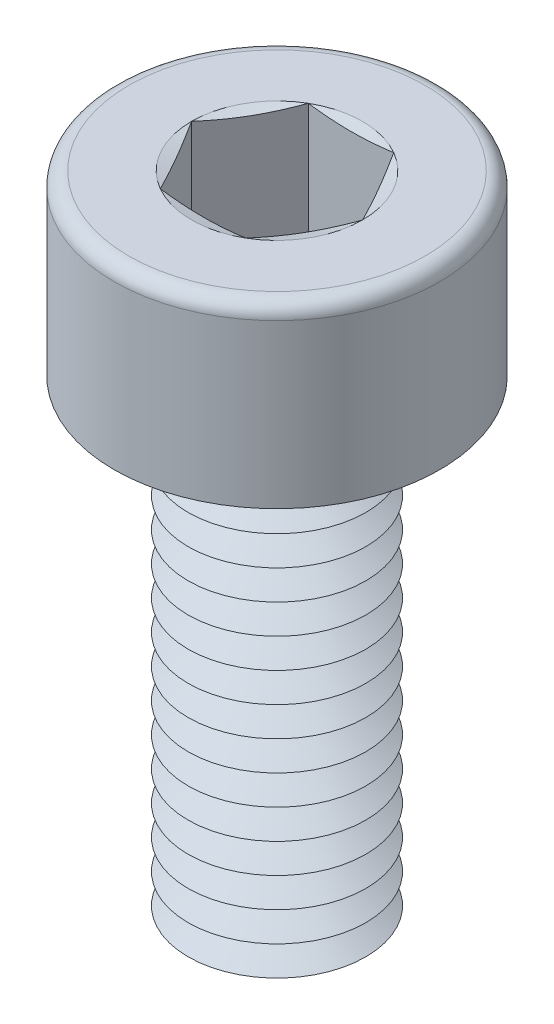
ISO-10303-21;
HEADER;
FILE_DESCRIPTION(('STEP AP214'),'2;1');
FILE_NAME('part.step','',(''),(''),'','','');
FILE_SCHEMA(('AUTOMOTIVE_DESIGN { 1 0 10303 214 1 1 1 1 }'));
ENDSEC;
DATA;
#1=APPLICATION_CONTEXT('core data for automotive mechanical design processes');
#2=APPLICATION_PROTOCOL_DEFINITION('international standard','automotive_design',2000,#1);
#3=PRODUCT_CONTEXT('',#1,'mechanical');
#4=PRODUCT('Part','Part','',(#3));
#5=PRODUCT_RELATED_PRODUCT_CATEGORY('part','',(#4));
#6=PRODUCT_DEFINITION_FORMATION('','',#4);
#7=PRODUCT_DEFINITION_CONTEXT('part definition',#1,'design');
#8=PRODUCT_DEFINITION('design','',#6,#7);
#9=PRODUCT_DEFINITION_SHAPE('','',#8);
#10=(LENGTH_UNIT() NAMED_UNIT(*) SI_UNIT(.MILLI.,.METRE.));
#11=(NAMED_UNIT(*) PLANE_ANGLE_UNIT() SI_UNIT($,.RADIAN.));
#12=(NAMED_UNIT(*) SI_UNIT($,.STERADIAN.) SOLID_ANGLE_UNIT());
#13=UNCERTAINTY_MEASURE_WITH_UNIT(LENGTH_MEASURE(1.E-05),#10,'distance_accuracy_value','');
#14=(GEOMETRIC_REPRESENTATION_CONTEXT(3) GLOBAL_UNCERTAINTY_ASSIGNED_CONTEXT((#13)) GLOBAL_UNIT_ASSIGNED_CONTEXT((#10,
#11,#12)) REPRESENTATION_CONTEXT('',''));
#15=CARTESIAN_POINT('',(0.,0.,0.));
#16=DIRECTION('',(0.,0.,1.));
#17=DIRECTION('',(1.,0.,0.));
#18=AXIS2_PLACEMENT_3D('',#15,#16,#17);
#19=CARTESIAN_POINT('',(0.,2.,0.));
#20=DIRECTION('',(0.,1.,0.));
#21=DIRECTION('',(0.,0.,1.));
#22=AXIS2_PLACEMENT_3D('',#19,#20,#21);
#23=CONICAL_SURFACE('',#22,1.06698729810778,1.0471975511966);
#24=CARTESIAN_POINT('',(0.,2.25,0.));
#25=DIRECTION('',(0.,1.,0.));
#26=DIRECTION('',(0.,0.,1.));
#27=AXIS2_PLACEMENT_3D('',#24,#25,#26);
#28=CIRCLE('',#27,1.5);
#29=CARTESIAN_POINT('',(0.,2.25,1.5));
#30=VERTEX_POINT('',#29);
#31=EDGE_CURVE('E439',#30,#30,#28,.T.);
#32=ORIENTED_EDGE('',*,*,#31,.F.);
#33=EDGE_LOOP('',(#32));
#34=FACE_BOUND('',#33,.T.);
#35=CARTESIAN_POINT('',(0.,2.,0.));
#36=DIRECTION('',(0.,1.,0.));
#37=DIRECTION('',(0.,0.,1.));
#38=AXIS2_PLACEMENT_3D('',#35,#36,#37);
#39=CIRCLE('',#38,1.06698729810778);
#40=CARTESIAN_POINT('',(0.,2.,1.06698729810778));
#41=VERTEX_POINT('',#40);
#42=EDGE_CURVE('E443',#41,#41,#39,.T.);
#43=ORIENTED_EDGE('',*,*,#42,.T.);
#44=EDGE_LOOP('',(#43));
#45=FACE_BOUND('',#44,.T.);
#46=ADVANCED_FACE('F41',(#34,#45),#23,.T.);
#47=CARTESIAN_POINT('',(0.,1.75,0.));
#48=DIRECTION('',(0.,-1.,0.));
#49=DIRECTION('',(0.,0.,-1.));
#50=AXIS2_PLACEMENT_3D('',#47,#48,#49);
#51=CONICAL_SURFACE('',#50,1.5,1.0471975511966);
#52=ORIENTED_EDGE('',*,*,#42,.F.);
#53=EDGE_LOOP('',(#52));
#54=FACE_BOUND('',#53,.T.);
#55=CARTESIAN_POINT('',(0.,1.75,0.));
#56=DIRECTION('',(0.,1.,0.));
#57=DIRECTION('',(0.,0.,1.));
#58=AXIS2_PLACEMENT_3D('',#55,#56,#57);
#59=CIRCLE('',#58,1.5);
#60=CARTESIAN_POINT('',(0.,1.75,1.5));
#61=VERTEX_POINT('',#60);
#62=EDGE_CURVE('E447',#61,#61,#59,.T.);
#63=ORIENTED_EDGE('',*,*,#62,.T.);
#64=EDGE_LOOP('',(#63));
#65=FACE_BOUND('',#64,.T.);
#66=ADVANCED_FACE('F250',(#54,#65),#51,.T.);
#67=CARTESIAN_POINT('',(0.,0.,0.));
#68=DIRECTION('',(0.,1.,0.));
#69=DIRECTION('',(0.,0.,1.));
#70=AXIS2_PLACEMENT_3D('',#67,#68,#69);
#71=PLANE('',#70);
#72=CARTESIAN_POINT('',(0.,0.,0.));
#73=DIRECTION('',(0.,1.,0.));
#74=DIRECTION('',(0.,0.,1.));
#75=AXIS2_PLACEMENT_3D('',#72,#73,#74);
#76=CIRCLE('',#75,1.06698729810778);
#77=CARTESIAN_POINT('',(0.,0.,1.06698729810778));
#78=VERTEX_POINT('',#77);
#79=EDGE_CURVE('E475',#78,#78,#76,.T.);
#80=ORIENTED_EDGE('',*,*,#79,.F.);
#81=EDGE_LOOP('',(#80));
#82=FACE_BOUND('',#81,.T.);
#83=ADVANCED_FACE('F247',(#82),#71,.F.);
#84=CARTESIAN_POINT('',(0.,0.,0.));
#85=DIRECTION('',(0.,1.,0.));
#86=DIRECTION('',(0.,0.,1.));
#87=AXIS2_PLACEMENT_3D('',#84,#85,#86);
#88=CONICAL_SURFACE('',#87,1.06698729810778,1.0471975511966);
#89=CARTESIAN_POINT('',(0.,0.25,0.));
#90=DIRECTION('',(0.,1.,0.));
#91=DIRECTION('',(0.,0.,1.));
#92=AXIS2_PLACEMENT_3D('',#89,#90,#91);
#93=CIRCLE('',#92,1.5);
#94=CARTESIAN_POINT('',(0.,0.25,1.5));
#95=VERTEX_POINT('',#94);
#96=EDGE_CURVE('E471',#95,#95,#93,.T.);
#97=ORIENTED_EDGE('',*,*,#96,.F.);
#98=EDGE_LOOP('',(#97));
#99=FACE_BOUND('',#98,.T.);
#100=ORIENTED_EDGE('',*,*,#79,.T.);
#101=EDGE_LOOP('',(#100));
#102=FACE_BOUND('',#101,.T.);
#103=ADVANCED_FACE('F249',(#99,#102),#88,.T.);
#104=CARTESIAN_POINT('',(0.,0.25,0.));
#105=DIRECTION('',(0.,-1.,0.));
#106=DIRECTION('',(0.,0.,-1.));
#107=AXIS2_PLACEMENT_3D('',#104,#105,#106);
#108=CONICAL_SURFACE('',#107,1.5,1.0471975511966);
#109=CARTESIAN_POINT('',(0.,0.5,0.));
#110=DIRECTION('',(0.,1.,0.));
#111=DIRECTION('',(0.,0.,1.));
#112=AXIS2_PLACEMENT_3D('',#109,#110,#111);
#113=CIRCLE('',#112,1.06698729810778);
#114=CARTESIAN_POINT('',(0.,0.5,1.06698729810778));
#115=VERTEX_POINT('',#114);
#116=EDGE_CURVE('E467',#115,#115,#113,.T.);
#117=ORIENTED_EDGE('',*,*,#116,.F.);
#118=EDGE_LOOP('',(#117));
#119=FACE_BOUND('',#118,.T.);
#120=ORIENTED_EDGE('',*,*,#96,.T.);
#121=EDGE_LOOP('',(#120));
#122=FACE_BOUND('',#121,.T.);
#123=ADVANCED_FACE('F290',(#119,#122),#108,.T.);
#124=CARTESIAN_POINT('',(0.,0.5,0.));
#125=DIRECTION('',(0.,1.,0.));
#126=DIRECTION('',(0.,0.,1.));
#127=AXIS2_PLACEMENT_3D('',#124,#125,#126);
#128=CONICAL_SURFACE('',#127,1.06698729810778,1.0471975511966);
#129=CARTESIAN_POINT('',(0.,0.75,0.));
#130=DIRECTION('',(0.,1.,0.));
#131=DIRECTION('',(0.,0.,1.));
#132=AXIS2_PLACEMENT_3D('',#129,#130,#131);
#133=CIRCLE('',#132,1.5);
#134=CARTESIAN_POINT('',(0.,0.75,1.5));
#135=VERTEX_POINT('',#134);
#136=EDGE_CURVE('E463',#135,#135,#133,.T.);
#137=ORIENTED_EDGE('',*,*,#136,.F.);
#138=EDGE_LOOP('',(#137));
#139=FACE_BOUND('',#138,.T.);
#140=ORIENTED_EDGE('',*,*,#116,.T.);
#141=EDGE_LOOP('',(#140));
#142=FACE_BOUND('',#141,.T.);
#143=ADVANCED_FACE('F285',(#139,#142),#128,.T.);
#144=CARTESIAN_POINT('',(0.,0.75,0.));
#145=DIRECTION('',(0.,-1.,0.));
#146=DIRECTION('',(0.,0.,-1.));
#147=AXIS2_PLACEMENT_3D('',#144,#145,#146);
#148=CONICAL_SURFACE('',#147,1.5,1.0471975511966);
#149=CARTESIAN_POINT('',(0.,1.,0.));
#150=DIRECTION('',(0.,1.,0.));
#151=DIRECTION('',(0.,0.,1.));
#152=AXIS2_PLACEMENT_3D('',#149,#150,#151);
#153=CIRCLE('',#152,1.06698729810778);
#154=CARTESIAN_POINT('',(0.,1.,1.06698729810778));
#155=VERTEX_POINT('',#154);
#156=EDGE_CURVE('E459',#155,#155,#153,.T.);
#157=ORIENTED_EDGE('',*,*,#156,.F.);
#158=EDGE_LOOP('',(#157));
#159=FACE_BOUND('',#158,.T.);
#160=ORIENTED_EDGE('',*,*,#136,.T.);
#161=EDGE_LOOP('',(#160));
#162=FACE_BOUND('',#161,.T.);
#163=ADVANCED_FACE('F282',(#159,#162),#148,.T.);
#164=CARTESIAN_POINT('',(0.,1.,0.));
#165=DIRECTION('',(0.,1.,0.));
#166=DIRECTION('',(0.,0.,1.));
#167=AXIS2_PLACEMENT_3D('',#164,#165,#166);
#168=CONICAL_SURFACE('',#167,1.06698729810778,1.0471975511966);
#169=CARTESIAN_POINT('',(0.,1.25,0.));
#170=DIRECTION('',(0.,1.,0.));
#171=DIRECTION('',(0.,0.,1.));
#172=AXIS2_PLACEMENT_3D('',#169,#170,#171);
#173=CIRCLE('',#172,1.5);
#174=CARTESIAN_POINT('',(0.,1.25,1.5));
#175=VERTEX_POINT('',#174);
#176=EDGE_CURVE('E455',#175,#175,#173,.T.);
#177=ORIENTED_EDGE('',*,*,#176,.F.);
#178=EDGE_LOOP('',(#177));
#179=FACE_BOUND('',#178,.T.);
#180=ORIENTED_EDGE('',*,*,#156,.T.);
#181=EDGE_LOOP('',(#180));
#182=FACE_BOUND('',#181,.T.);
#183=ADVANCED_FACE('F276',(#179,#182),#168,.T.);
#184=CARTESIAN_POINT('',(0.,1.25,0.));
#185=DIRECTION('',(0.,-1.,0.));
#186=DIRECTION('',(0.,0.,-1.));
#187=AXIS2_PLACEMENT_3D('',#184,#185,#186);
#188=CONICAL_SURFACE('',#187,1.5,1.0471975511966);
#189=CARTESIAN_POINT('',(0.,1.5,0.));
#190=DIRECTION('',(0.,1.,0.));
#191=DIRECTION('',(0.,0.,1.));
#192=AXIS2_PLACEMENT_3D('',#189,#190,#191);
#193=CIRCLE('',#192,1.06698729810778);
#194=CARTESIAN_POINT('',(0.,1.5,1.06698729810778));
#195=VERTEX_POINT('',#194);
#196=EDGE_CURVE('E451',#195,#195,#193,.T.);
#197=ORIENTED_EDGE('',*,*,#196,.F.);
#198=EDGE_LOOP('',(#197));
#199=FACE_BOUND('',#198,.T.);
#200=ORIENTED_EDGE('',*,*,#176,.T.);
#201=EDGE_LOOP('',(#200));
#202=FACE_BOUND('',#201,.T.);
#203=ADVANCED_FACE('F272',(#199,#202),#188,.T.);
#204=CARTESIAN_POINT('',(0.,1.5,0.));
#205=DIRECTION('',(0.,1.,0.));
#206=DIRECTION('',(0.,0.,1.));
#207=AXIS2_PLACEMENT_3D('',#204,#205,#206);
#208=CONICAL_SURFACE('',#207,1.06698729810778,1.0471975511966);
#209=ORIENTED_EDGE('',*,*,#62,.F.);
#210=EDGE_LOOP('',(#209));
#211=FACE_BOUND('',#210,.T.);
#212=ORIENTED_EDGE('',*,*,#196,.T.);
#213=EDGE_LOOP('',(#212));
#214=FACE_BOUND('',#213,.T.);
#215=ADVANCED_FACE('F275',(#211,#214),#208,.T.);
#216=CARTESIAN_POINT('',(0.,2.5,0.));
#217=DIRECTION('',(0.,1.,0.));
#218=DIRECTION('',(0.,0.,1.));
#219=AXIS2_PLACEMENT_3D('',#216,#217,#218);
#220=CONICAL_SURFACE('',#219,1.06698729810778,1.0471975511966);
#221=CARTESIAN_POINT('',(0.,2.75,0.));
#222=DIRECTION('',(0.,1.,0.));
#223=DIRECTION('',(0.,0.,1.));
#224=AXIS2_PLACEMENT_3D('',#221,#222,#223);
#225=CIRCLE('',#224,1.5);
#226=CARTESIAN_POINT('',(0.,2.75,1.5));
#227=VERTEX_POINT('',#226);
#228=EDGE_CURVE('E431',#227,#227,#225,.T.);
#229=ORIENTED_EDGE('',*,*,#228,.F.);
#230=EDGE_LOOP('',(#229));
#231=FACE_BOUND('',#230,.T.);
#232=CARTESIAN_POINT('',(0.,2.5,0.));
#233=DIRECTION('',(0.,1.,0.));
#234=DIRECTION('',(0.,0.,1.));
#235=AXIS2_PLACEMENT_3D('',#232,#233,#234);
#236=CIRCLE('',#235,1.06698729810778);
#237=CARTESIAN_POINT('',(0.,2.5,1.06698729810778));
#238=VERTEX_POINT('',#237);
#239=EDGE_CURVE('E435',#238,#238,#236,.T.);
#240=ORIENTED_EDGE('',*,*,#239,.T.);
#241=EDGE_LOOP('',(#240));
#242=FACE_BOUND('',#241,.T.);
#243=ADVANCED_FACE('F280',(#231,#242),#220,.T.);
#244=CARTESIAN_POINT('',(0.,2.25,0.));
#245=DIRECTION('',(0.,-1.,0.));
#246=DIRECTION('',(0.,0.,-1.));
#247=AXIS2_PLACEMENT_3D('',#244,#245,#246);
#248=CONICAL_SURFACE('',#247,1.5,1.0471975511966);
#249=ORIENTED_EDGE('',*,*,#239,.F.);
#250=EDGE_LOOP('',(#249));
#251=FACE_BOUND('',#250,.T.);
#252=ORIENTED_EDGE('',*,*,#31,.T.);
#253=EDGE_LOOP('',(#252));
#254=FACE_BOUND('',#253,.T.);
#255=ADVANCED_FACE('F801',(#251,#254),#248,.T.);
#256=CARTESIAN_POINT('',(0.,3.,0.));
#257=DIRECTION('',(0.,1.,0.));
#258=DIRECTION('',(0.,0.,1.));
#259=AXIS2_PLACEMENT_3D('',#256,#257,#258);
#260=CONICAL_SURFACE('',#259,1.06698729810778,1.0471975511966);
#261=CARTESIAN_POINT('',(0.,3.25,0.));
#262=DIRECTION('',(0.,1.,0.));
#263=DIRECTION('',(0.,0.,1.));
#264=AXIS2_PLACEMENT_3D('',#261,#262,#263);
#265=CIRCLE('',#264,1.5);
#266=CARTESIAN_POINT('',(0.,3.25,1.5));
#267=VERTEX_POINT('',#266);
#268=EDGE_CURVE('E423',#267,#267,#265,.T.);
#269=ORIENTED_EDGE('',*,*,#268,.F.);
#270=EDGE_LOOP('',(#269));
#271=FACE_BOUND('',#270,.T.);
#272=CARTESIAN_POINT('',(0.,3.,0.));
#273=DIRECTION('',(0.,1.,0.));
#274=DIRECTION('',(0.,0.,1.));
#275=AXIS2_PLACEMENT_3D('',#272,#273,#274);
#276=CIRCLE('',#275,1.06698729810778);
#277=CARTESIAN_POINT('',(0.,3.,1.06698729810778));
#278=VERTEX_POINT('',#277);
#279=EDGE_CURVE('E427',#278,#278,#276,.T.);
#280=ORIENTED_EDGE('',*,*,#279,.T.);
#281=EDGE_LOOP('',(#280));
#282=FACE_BOUND('',#281,.T.);
#283=ADVANCED_FACE('F792',(#271,#282),#260,.T.);
#284=CARTESIAN_POINT('',(0.,2.75,0.));
#285=DIRECTION('',(0.,-1.,0.));
#286=DIRECTION('',(0.,0.,-1.));
#287=AXIS2_PLACEMENT_3D('',#284,#285,#286);
#288=CONICAL_SURFACE('',#287,1.5,1.0471975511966);
#289=ORIENTED_EDGE('',*,*,#279,.F.);
#290=EDGE_LOOP('',(#289));
#291=FACE_BOUND('',#290,.T.);
#292=ORIENTED_EDGE('',*,*,#228,.T.);
#293=EDGE_LOOP('',(#292));
#294=FACE_BOUND('',#293,.T.);
#295=ADVANCED_FACE('F783',(#291,#294),#288,.T.);
#296=CARTESIAN_POINT('',(0.,3.5,0.));
#297=DIRECTION('',(0.,1.,0.));
#298=DIRECTION('',(0.,0.,1.));
#299=AXIS2_PLACEMENT_3D('',#296,#297,#298);
#300=CONICAL_SURFACE('',#299,1.06698729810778,1.0471975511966);
#301=CARTESIAN_POINT('',(0.,3.75,0.));
#302=DIRECTION('',(0.,1.,0.));
#303=DIRECTION('',(0.,0.,1.));
#304=AXIS2_PLACEMENT_3D('',#301,#302,#303);
#305=CIRCLE('',#304,1.5);
#306=CARTESIAN_POINT('',(0.,3.75,1.5));
#307=VERTEX_POINT('',#306);
#308=EDGE_CURVE('E415',#307,#307,#305,.T.);
#309=ORIENTED_EDGE('',*,*,#308,.F.);
#310=EDGE_LOOP('',(#309));
#311=FACE_BOUND('',#310,.T.);
#312=CARTESIAN_POINT('',(0.,3.5,0.));
#313=DIRECTION('',(0.,1.,0.));
#314=DIRECTION('',(0.,0.,1.));
#315=AXIS2_PLACEMENT_3D('',#312,#313,#314);
#316=CIRCLE('',#315,1.06698729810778);
#317=CARTESIAN_POINT('',(0.,3.5,1.06698729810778));
#318=VERTEX_POINT('',#317);
#319=EDGE_CURVE('E419',#318,#318,#316,.T.);
#320=ORIENTED_EDGE('',*,*,#319,.T.);
#321=EDGE_LOOP('',(#320));
#322=FACE_BOUND('',#321,.T.);
#323=ADVANCED_FACE('F774',(#311,#322),#300,.T.);
#324=CARTESIAN_POINT('',(0.,3.25,0.));
#325=DIRECTION('',(0.,-1.,0.));
#326=DIRECTION('',(0.,0.,-1.));
#327=AXIS2_PLACEMENT_3D('',#324,#325,#326);
#328=CONICAL_SURFACE('',#327,1.5,1.0471975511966);
#329=ORIENTED_EDGE('',*,*,#319,.F.);
#330=EDGE_LOOP('',(#329));
#331=FACE_BOUND('',#330,.T.);
#332=ORIENTED_EDGE('',*,*,#268,.T.);
#333=EDGE_LOOP('',(#332));
#334=FACE_BOUND('',#333,.T.);
#335=ADVANCED_FACE('F765',(#331,#334),#328,.T.);
#336=CARTESIAN_POINT('',(0.,4.,0.));
#337=DIRECTION('',(0.,1.,0.));
#338=DIRECTION('',(0.,0.,1.));
#339=AXIS2_PLACEMENT_3D('',#336,#337,#338);
#340=CONICAL_SURFACE('',#339,1.06698729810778,1.0471975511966);
#341=CARTESIAN_POINT('',(0.,4.25,0.));
#342=DIRECTION('',(0.,1.,0.));
#343=DIRECTION('',(0.,0.,1.));
#344=AXIS2_PLACEMENT_3D('',#341,#342,#343);
#345=CIRCLE('',#344,1.5);
#346=CARTESIAN_POINT('',(0.,4.25,1.5));
#347=VERTEX_POINT('',#346);
#348=EDGE_CURVE('E407',#347,#347,#345,.T.);
#349=ORIENTED_EDGE('',*,*,#348,.F.);
#350=EDGE_LOOP('',(#349));
#351=FACE_BOUND('',#350,.T.);
#352=CARTESIAN_POINT('',(0.,4.,0.));
#353=DIRECTION('',(0.,1.,0.));
#354=DIRECTION('',(0.,0.,1.));
#355=AXIS2_PLACEMENT_3D('',#352,#353,#354);
#356=CIRCLE('',#355,1.06698729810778);
#357=CARTESIAN_POINT('',(0.,4.,1.06698729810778));
#358=VERTEX_POINT('',#357);
#359=EDGE_CURVE('E411',#358,#358,#356,.T.);
#360=ORIENTED_EDGE('',*,*,#359,.T.);
#361=EDGE_LOOP('',(#360));
#362=FACE_BOUND('',#361,.T.);
#363=ADVANCED_FACE('F756',(#351,#362),#340,.T.);
#364=CARTESIAN_POINT('',(0.,3.75,0.));
#365=DIRECTION('',(0.,-1.,0.));
#366=DIRECTION('',(0.,0.,-1.));
#367=AXIS2_PLACEMENT_3D('',#364,#365,#366);
#368=CONICAL_SURFACE('',#367,1.5,1.0471975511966);
#369=ORIENTED_EDGE('',*,*,#359,.F.);
#370=EDGE_LOOP('',(#369));
#371=FACE_BOUND('',#370,.T.);
#372=ORIENTED_EDGE('',*,*,#308,.T.);
#373=EDGE_LOOP('',(#372));
#374=FACE_BOUND('',#373,.T.);
#375=ADVANCED_FACE('F747',(#371,#374),#368,.T.);
#376=CARTESIAN_POINT('',(0.,4.5,0.));
#377=DIRECTION('',(0.,1.,0.));
#378=DIRECTION('',(0.,0.,1.));
#379=AXIS2_PLACEMENT_3D('',#376,#377,#378);
#380=CONICAL_SURFACE('',#379,1.06698729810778,1.0471975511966);
#381=CARTESIAN_POINT('',(0.,4.75,0.));
#382=DIRECTION('',(0.,1.,0.));
#383=DIRECTION('',(0.,0.,1.));
#384=AXIS2_PLACEMENT_3D('',#381,#382,#383);
#385=CIRCLE('',#384,1.5);
#386=CARTESIAN_POINT('',(0.,4.75,1.5));
#387=VERTEX_POINT('',#386);
#388=EDGE_CURVE('E399',#387,#387,#385,.T.);
#389=ORIENTED_EDGE('',*,*,#388,.F.);
#390=EDGE_LOOP('',(#389));
#391=FACE_BOUND('',#390,.T.);
#392=CARTESIAN_POINT('',(0.,4.5,0.));
#393=DIRECTION('',(0.,1.,0.));
#394=DIRECTION('',(0.,0.,1.));
#395=AXIS2_PLACEMENT_3D('',#392,#393,#394);
#396=CIRCLE('',#395,1.06698729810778);
#397=CARTESIAN_POINT('',(0.,4.5,1.06698729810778));
#398=VERTEX_POINT('',#397);
#399=EDGE_CURVE('E403',#398,#398,#396,.T.);
#400=ORIENTED_EDGE('',*,*,#399,.T.);
#401=EDGE_LOOP('',(#400));
#402=FACE_BOUND('',#401,.T.);
#403=ADVANCED_FACE('F738',(#391,#402),#380,.T.);
#404=CARTESIAN_POINT('',(0.,4.25,0.));
#405=DIRECTION('',(0.,-1.,0.));
#406=DIRECTION('',(0.,0.,-1.));
#407=AXIS2_PLACEMENT_3D('',#404,#405,#406);
#408=CONICAL_SURFACE('',#407,1.5,1.0471975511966);
#409=ORIENTED_EDGE('',*,*,#399,.F.);
#410=EDGE_LOOP('',(#409));
#411=FACE_BOUND('',#410,.T.);
#412=ORIENTED_EDGE('',*,*,#348,.T.);
#413=EDGE_LOOP('',(#412));
#414=FACE_BOUND('',#413,.T.);
#415=ADVANCED_FACE('F729',(#411,#414),#408,.T.);
#416=CARTESIAN_POINT('',(0.,5.,0.));
#417=DIRECTION('',(0.,1.,0.));
#418=DIRECTION('',(0.,0.,1.));
#419=AXIS2_PLACEMENT_3D('',#416,#417,#418);
#420=CONICAL_SURFACE('',#419,1.06698729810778,1.0471975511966);
#421=CARTESIAN_POINT('',(0.,5.25,0.));
#422=DIRECTION('',(0.,1.,0.));
#423=DIRECTION('',(0.,0.,1.));
#424=AXIS2_PLACEMENT_3D('',#421,#422,#423);
#425=CIRCLE('',#424,1.5);
#426=CARTESIAN_POINT('',(0.,5.25,1.5));
#427=VERTEX_POINT('',#426);
#428=EDGE_CURVE('E391',#427,#427,#425,.T.);
#429=ORIENTED_EDGE('',*,*,#428,.F.);
#430=EDGE_LOOP('',(#429));
#431=FACE_BOUND('',#430,.T.);
#432=CARTESIAN_POINT('',(0.,5.,0.));
#433=DIRECTION('',(0.,1.,0.));
#434=DIRECTION('',(0.,0.,1.));
#435=AXIS2_PLACEMENT_3D('',#432,#433,#434);
#436=CIRCLE('',#435,1.06698729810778);
#437=CARTESIAN_POINT('',(0.,5.,1.06698729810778));
#438=VERTEX_POINT('',#437);
#439=EDGE_CURVE('E395',#438,#438,#436,.T.);
#440=ORIENTED_EDGE('',*,*,#439,.T.);
#441=EDGE_LOOP('',(#440));
#442=FACE_BOUND('',#441,.T.);
#443=ADVANCED_FACE('F720',(#431,#442),#420,.T.);
#444=CARTESIAN_POINT('',(0.,4.75,0.));
#445=DIRECTION('',(0.,-1.,0.));
#446=DIRECTION('',(0.,0.,-1.));
#447=AXIS2_PLACEMENT_3D('',#444,#445,#446);
#448=CONICAL_SURFACE('',#447,1.5,1.0471975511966);
#449=ORIENTED_EDGE('',*,*,#439,.F.);
#450=EDGE_LOOP('',(#449));
#451=FACE_BOUND('',#450,.T.);
#452=ORIENTED_EDGE('',*,*,#388,.T.);
#453=EDGE_LOOP('',(#452));
#454=FACE_BOUND('',#453,.T.);
#455=ADVANCED_FACE('F711',(#451,#454),#448,.T.);
#456=CARTESIAN_POINT('',(0.,5.5,0.));
#457=DIRECTION('',(0.,1.,0.));
#458=DIRECTION('',(0.,0.,1.));
#459=AXIS2_PLACEMENT_3D('',#456,#457,#458);
#460=CONICAL_SURFACE('',#459,1.06698729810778,1.0471975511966);
#461=CARTESIAN_POINT('',(0.,5.75,0.));
#462=DIRECTION('',(0.,1.,0.));
#463=DIRECTION('',(0.,0.,1.));
#464=AXIS2_PLACEMENT_3D('',#461,#462,#463);
#465=CIRCLE('',#464,1.5);
#466=CARTESIAN_POINT('',(0.,5.75,1.5));
#467=VERTEX_POINT('',#466);
#468=EDGE_CURVE('E383',#467,#467,#465,.T.);
#469=ORIENTED_EDGE('',*,*,#468,.F.);
#470=EDGE_LOOP('',(#469));
#471=FACE_BOUND('',#470,.T.);
#472=CARTESIAN_POINT('',(0.,5.5,0.));
#473=DIRECTION('',(0.,1.,0.));
#474=DIRECTION('',(0.,0.,1.));
#475=AXIS2_PLACEMENT_3D('',#472,#473,#474);
#476=CIRCLE('',#475,1.06698729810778);
#477=CARTESIAN_POINT('',(0.,5.5,1.06698729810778));
#478=VERTEX_POINT('',#477);
#479=EDGE_CURVE('E387',#478,#478,#476,.T.);
#480=ORIENTED_EDGE('',*,*,#479,.T.);
#481=EDGE_LOOP('',(#480));
#482=FACE_BOUND('',#481,.T.);
#483=ADVANCED_FACE('F702',(#471,#482),#460,.T.);
#484=CARTESIAN_POINT('',(0.,5.25,0.));
#485=DIRECTION('',(0.,-1.,0.));
#486=DIRECTION('',(0.,0.,-1.));
#487=AXIS2_PLACEMENT_3D('',#484,#485,#486);
#488=CONICAL_SURFACE('',#487,1.5,1.0471975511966);
#489=ORIENTED_EDGE('',*,*,#479,.F.);
#490=EDGE_LOOP('',(#489));
#491=FACE_BOUND('',#490,.T.);
#492=ORIENTED_EDGE('',*,*,#428,.T.);
#493=EDGE_LOOP('',(#492));
#494=FACE_BOUND('',#493,.T.);
#495=ADVANCED_FACE('F693',(#491,#494),#488,.T.);
#496=CARTESIAN_POINT('',(0.,6.,0.));
#497=DIRECTION('',(0.,1.,0.));
#498=DIRECTION('',(0.,0.,1.));
#499=AXIS2_PLACEMENT_3D('',#496,#497,#498);
#500=CONICAL_SURFACE('',#499,1.06698729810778,1.0471975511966);
#501=CARTESIAN_POINT('',(0.,6.25,0.));
#502=DIRECTION('',(0.,1.,0.));
#503=DIRECTION('',(0.,0.,1.));
#504=AXIS2_PLACEMENT_3D('',#501,#502,#503);
#505=CIRCLE('',#504,1.5);
#506=CARTESIAN_POINT('',(0.,6.25,1.5));
#507=VERTEX_POINT('',#506);
#508=EDGE_CURVE('E376',#507,#507,#505,.T.);
#509=ORIENTED_EDGE('',*,*,#508,.F.);
#510=EDGE_LOOP('',(#509));
#511=FACE_BOUND('',#510,.T.);
#512=CARTESIAN_POINT('',(0.,6.,0.));
#513=DIRECTION('',(0.,1.,0.));
#514=DIRECTION('',(0.,0.,1.));
#515=AXIS2_PLACEMENT_3D('',#512,#513,#514);
#516=CIRCLE('',#515,1.06698729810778);
#517=CARTESIAN_POINT('',(0.,6.,1.06698729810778));
#518=VERTEX_POINT('',#517);
#519=EDGE_CURVE('E380',#518,#518,#516,.T.);
#520=ORIENTED_EDGE('',*,*,#519,.T.);
#521=EDGE_LOOP('',(#520));
#522=FACE_BOUND('',#521,.T.);
#523=ADVANCED_FACE('F684',(#511,#522),#500,.T.);
#524=CARTESIAN_POINT('',(0.,5.75,0.));
#525=DIRECTION('',(0.,-1.,0.));
#526=DIRECTION('',(0.,0.,-1.));
#527=AXIS2_PLACEMENT_3D('',#524,#525,#526);
#528=CONICAL_SURFACE('',#527,1.5,1.0471975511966);
#529=ORIENTED_EDGE('',*,*,#519,.F.);
#530=EDGE_LOOP('',(#529));
#531=FACE_BOUND('',#530,.T.);
#532=ORIENTED_EDGE('',*,*,#468,.T.);
#533=EDGE_LOOP('',(#532));
#534=FACE_BOUND('',#533,.T.);
#535=ADVANCED_FACE('F675',(#531,#534),#528,.T.);
#536=CARTESIAN_POINT('',(0.,6.5,0.));
#537=DIRECTION('',(0.,1.,0.));
#538=DIRECTION('',(0.,0.,1.));
#539=AXIS2_PLACEMENT_3D('',#536,#537,#538);
#540=CONICAL_SURFACE('',#539,1.06698729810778,1.0471975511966);
#541=CARTESIAN_POINT('',(0.,6.75,0.));
#542=DIRECTION('',(0.,1.,0.));
#543=DIRECTION('',(0.,0.,1.));
#544=AXIS2_PLACEMENT_3D('',#541,#542,#543);
#545=CIRCLE('',#544,1.5);
#546=CARTESIAN_POINT('',(0.,6.75,1.5));
#547=VERTEX_POINT('',#546);
#548=EDGE_CURVE('E368',#547,#547,#545,.T.);
#549=ORIENTED_EDGE('',*,*,#548,.F.);
#550=EDGE_LOOP('',(#549));
#551=FACE_BOUND('',#550,.T.);
#552=CARTESIAN_POINT('',(0.,6.5,0.));
#553=DIRECTION('',(0.,1.,0.));
#554=DIRECTION('',(0.,0.,1.));
#555=AXIS2_PLACEMENT_3D('',#552,#553,#554);
#556=CIRCLE('',#555,1.06698729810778);
#557=CARTESIAN_POINT('',(0.,6.5,1.06698729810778));
#558=VERTEX_POINT('',#557);
#559=EDGE_CURVE('E372',#558,#558,#556,.T.);
#560=ORIENTED_EDGE('',*,*,#559,.T.);
#561=EDGE_LOOP('',(#560));
#562=FACE_BOUND('',#561,.T.);
#563=ADVANCED_FACE('F666',(#551,#562),#540,.T.);
#564=CARTESIAN_POINT('',(0.,6.25,0.));
#565=DIRECTION('',(0.,-1.,0.));
#566=DIRECTION('',(0.,0.,-1.));
#567=AXIS2_PLACEMENT_3D('',#564,#565,#566);
#568=CONICAL_SURFACE('',#567,1.5,1.0471975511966);
#569=ORIENTED_EDGE('',*,*,#559,.F.);
#570=EDGE_LOOP('',(#569));
#571=FACE_BOUND('',#570,.T.);
#572=ORIENTED_EDGE('',*,*,#508,.T.);
#573=EDGE_LOOP('',(#572));
#574=FACE_BOUND('',#573,.T.);
#575=ADVANCED_FACE('F657',(#571,#574),#568,.T.);
#576=CARTESIAN_POINT('',(0.,7.,0.));
#577=DIRECTION('',(0.,1.,0.));
#578=DIRECTION('',(0.,0.,1.));
#579=AXIS2_PLACEMENT_3D('',#576,#577,#578);
#580=CONICAL_SURFACE('',#579,1.06698729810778,1.0471975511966);
#581=CARTESIAN_POINT('',(0.,7.25,0.));
#582=DIRECTION('',(0.,1.,0.));
#583=DIRECTION('',(0.,0.,1.));
#584=AXIS2_PLACEMENT_3D('',#581,#582,#583);
#585=CIRCLE('',#584,1.5);
#586=CARTESIAN_POINT('',(0.,7.25,1.5));
#587=VERTEX_POINT('',#586);
#588=EDGE_CURVE('E352',#587,#587,#585,.T.);
#589=ORIENTED_EDGE('',*,*,#588,.F.);
#590=EDGE_LOOP('',(#589));
#591=FACE_BOUND('',#590,.T.);
#592=CARTESIAN_POINT('',(0.,7.,0.));
#593=DIRECTION('',(0.,1.,0.));
#594=DIRECTION('',(0.,0.,1.));
#595=AXIS2_PLACEMENT_3D('',#592,#593,#594);
#596=CIRCLE('',#595,1.06698729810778);
#597=CARTESIAN_POINT('',(0.,7.,1.06698729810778));
#598=VERTEX_POINT('',#597);
#599=EDGE_CURVE('E364',#598,#598,#596,.T.);
#600=ORIENTED_EDGE('',*,*,#599,.T.);
#601=EDGE_LOOP('',(#600));
#602=FACE_BOUND('',#601,.T.);
#603=ADVANCED_FACE('F648',(#591,#602),#580,.T.);
#604=CARTESIAN_POINT('',(0.,6.75,0.));
#605=DIRECTION('',(0.,-1.,0.));
#606=DIRECTION('',(0.,0.,-1.));
#607=AXIS2_PLACEMENT_3D('',#604,#605,#606);
#608=CONICAL_SURFACE('',#607,1.5,1.0471975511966);
#609=ORIENTED_EDGE('',*,*,#599,.F.);
#610=EDGE_LOOP('',(#609));
#611=FACE_BOUND('',#610,.T.);
#612=ORIENTED_EDGE('',*,*,#548,.T.);
#613=EDGE_LOOP('',(#612));
#614=FACE_BOUND('',#613,.T.);
#615=ADVANCED_FACE('F640',(#611,#614),#608,.T.);
#616=CARTESIAN_POINT('',(0.,7.5,0.));
#617=DIRECTION('',(0.,1.,0.));
#618=DIRECTION('',(0.,0.,1.));
#619=AXIS2_PLACEMENT_3D('',#616,#617,#618);
#620=CONICAL_SURFACE('',#619,1.06698729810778,1.0471975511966);
#621=CARTESIAN_POINT('',(0.,7.75,0.));
#622=DIRECTION('',(0.,1.,0.));
#623=DIRECTION('',(0.,0.,1.));
#624=AXIS2_PLACEMENT_3D('',#621,#622,#623);
#625=CIRCLE('',#624,1.5);
#626=CARTESIAN_POINT('',(0.,7.75,1.5));
#627=VERTEX_POINT('',#626);
#628=EDGE_CURVE('E359',#627,#627,#625,.T.);
#629=ORIENTED_EDGE('',*,*,#628,.F.);
#630=EDGE_LOOP('',(#629));
#631=FACE_BOUND('',#630,.T.);
#632=CARTESIAN_POINT('',(0.,7.5,0.));
#633=DIRECTION('',(0.,1.,0.));
#634=DIRECTION('',(0.,0.,1.));
#635=AXIS2_PLACEMENT_3D('',#632,#633,#634);
#636=CIRCLE('',#635,1.06698729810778);
#637=CARTESIAN_POINT('',(0.,7.5,1.06698729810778));
#638=VERTEX_POINT('',#637);
#639=EDGE_CURVE('E347',#638,#638,#636,.T.);
#640=ORIENTED_EDGE('',*,*,#639,.T.);
#641=EDGE_LOOP('',(#640));
#642=FACE_BOUND('',#641,.T.);
#643=ADVANCED_FACE('F632',(#631,#642),#620,.T.);
#644=CARTESIAN_POINT('',(0.,7.25,0.));
#645=DIRECTION('',(0.,-1.,0.));
#646=DIRECTION('',(0.,0.,-1.));
#647=AXIS2_PLACEMENT_3D('',#644,#645,#646);
#648=CONICAL_SURFACE('',#647,1.5,1.0471975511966);
#649=ORIENTED_EDGE('',*,*,#639,.F.);
#650=EDGE_LOOP('',(#649));
#651=FACE_BOUND('',#650,.T.);
#652=ORIENTED_EDGE('',*,*,#588,.T.);
#653=EDGE_LOOP('',(#652));
#654=FACE_BOUND('',#653,.T.);
#655=ADVANCED_FACE('F194',(#651,#654),#648,.T.);
#656=CARTESIAN_POINT('',(0.,11.,0.));
#657=DIRECTION('',(0.,1.,0.));
#658=DIRECTION('',(0.,0.,1.));
#659=AXIS2_PLACEMENT_3D('',#656,#657,#658);
#660=PLANE('',#659);
#661=CARTESIAN_POINT('',(0.,11.,0.));
#662=DIRECTION('',(0.,1.,0.));
#663=DIRECTION('',(0.,0.,1.));
#664=AXIS2_PLACEMENT_3D('',#661,#662,#663);
#665=CIRCLE('',#664,1.44337567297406);
#666=CARTESIAN_POINT('',(0.721687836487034,11.,1.25));
#667=VERTEX_POINT('',#666);
#668=CARTESIAN_POINT('',(1.44337567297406,11.,0.));
#669=VERTEX_POINT('',#668);
#670=EDGE_CURVE('E121',#667,#669,#665,.T.);
#671=ORIENTED_EDGE('',*,*,#670,.F.);
#672=CARTESIAN_POINT('',(0.,11.,0.));
#673=DIRECTION('',(0.,1.,0.));
#674=DIRECTION('',(0.,0.,1.));
#675=AXIS2_PLACEMENT_3D('',#672,#673,#674);
#676=CIRCLE('',#675,1.44337567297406);
#677=CARTESIAN_POINT('',(-0.721687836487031,11.,1.25));
#678=VERTEX_POINT('',#677);
#679=EDGE_CURVE('E45',#678,#667,#676,.T.);
#680=ORIENTED_EDGE('',*,*,#679,.F.);
#681=CARTESIAN_POINT('',(-1.44337567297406,11.,0.));
#682=VERTEX_POINT('',#681);
#683=EDGE_CURVE('E138',#682,#678,#676,.T.);
#684=ORIENTED_EDGE('',*,*,#683,.F.);
#685=CARTESIAN_POINT('',(-0.721687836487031,11.,-1.25));
#686=VERTEX_POINT('',#685);
#687=EDGE_CURVE('E552',#686,#682,#676,.T.);
#688=ORIENTED_EDGE('',*,*,#687,.F.);
#689=CARTESIAN_POINT('',(0.721687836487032,11.,-1.25));
#690=VERTEX_POINT('',#689);
#691=EDGE_CURVE('E51',#690,#686,#676,.T.);
#692=ORIENTED_EDGE('',*,*,#691,.F.);
#693=EDGE_CURVE('E11',#669,#690,#676,.T.);
#694=ORIENTED_EDGE('',*,*,#693,.F.);
#695=EDGE_LOOP('',(#671,#680,#684,#688,#692,#694));
#696=FACE_BOUND('',#695,.T.);
#697=CARTESIAN_POINT('',(0.,11.,0.));
#698=DIRECTION('',(0.,1.,0.));
#699=DIRECTION('',(0.,0.,1.));
#700=AXIS2_PLACEMENT_3D('',#697,#698,#699);
#701=CIRCLE('',#700,2.5);
#702=CARTESIAN_POINT('',(0.,11.,2.5));
#703=VERTEX_POINT('',#702);
#704=EDGE_CURVE('E519',#703,#703,#701,.T.);
#705=ORIENTED_EDGE('',*,*,#704,.T.);
#706=EDGE_LOOP('',(#705));
#707=FACE_BOUND('',#706,.T.);
#708=ADVANCED_FACE('F140',(#696,#707),#660,.T.);
#709=CARTESIAN_POINT('',(0.,10.75,0.));
#710=DIRECTION('',(0.,1.,0.));
#711=DIRECTION('',(0.,0.,1.));
#712=AXIS2_PLACEMENT_3D('',#709,#710,#711);
#713=TOROIDAL_SURFACE('',#712,2.5,0.25);
#714=CARTESIAN_POINT('',(0.,10.75,0.));
#715=DIRECTION('',(0.,1.,0.));
#716=DIRECTION('',(0.,0.,1.));
#717=AXIS2_PLACEMENT_3D('',#714,#715,#716);
#718=CIRCLE('',#717,2.75);
#719=CARTESIAN_POINT('',(0.,10.75,2.75));
#720=VERTEX_POINT('',#719);
#721=EDGE_CURVE('E523',#720,#720,#718,.F.);
#722=ORIENTED_EDGE('',*,*,#721,.F.);
#723=EDGE_LOOP('',(#722));
#724=FACE_BOUND('',#723,.T.);
#725=ORIENTED_EDGE('',*,*,#704,.F.);
#726=EDGE_LOOP('',(#725));
#727=FACE_BOUND('',#726,.T.);
#728=ADVANCED_FACE('F43',(#724,#727),#713,.T.);
#729=CARTESIAN_POINT('',(0.,11.,0.));
#730=DIRECTION('',(0.,-1.,0.));
#731=DIRECTION('',(0.,0.,-1.));
#732=AXIS2_PLACEMENT_3D('',#729,#730,#731);
#733=CYLINDRICAL_SURFACE('',#732,2.75);
#734=ORIENTED_EDGE('',*,*,#721,.T.);
#735=EDGE_LOOP('',(#734));
#736=FACE_BOUND('',#735,.T.);
#737=CARTESIAN_POINT('',(0.,8.,0.));
#738=DIRECTION('',(0.,1.,0.));
#739=DIRECTION('',(0.,0.,1.));
#740=AXIS2_PLACEMENT_3D('',#737,#738,#739);
#741=CIRCLE('',#740,2.75);
#742=CARTESIAN_POINT('',(0.,8.,2.75));
#743=VERTEX_POINT('',#742);
#744=EDGE_CURVE('E506',#743,#743,#741,.T.);
#745=ORIENTED_EDGE('',*,*,#744,.T.);
#746=EDGE_LOOP('',(#745));
#747=FACE_BOUND('',#746,.T.);
#748=ADVANCED_FACE('F242',(#736,#747),#733,.T.);
#749=CARTESIAN_POINT('',(0.,8.,0.));
#750=DIRECTION('',(0.,1.,0.));
#751=DIRECTION('',(0.,0.,1.));
#752=AXIS2_PLACEMENT_3D('',#749,#750,#751);
#753=PLANE('',#752);
#754=ORIENTED_EDGE('',*,*,#744,.F.);
#755=EDGE_LOOP('',(#754));
#756=FACE_BOUND('',#755,.T.);
#757=CARTESIAN_POINT('',(0.,8.,0.));
#758=DIRECTION('',(0.,1.,0.));
#759=DIRECTION('',(0.,0.,1.));
#760=AXIS2_PLACEMENT_3D('',#757,#758,#759);
#761=CIRCLE('',#760,1.5);
#762=CARTESIAN_POINT('',(0.,8.,1.5));
#763=VERTEX_POINT('',#762);
#764=EDGE_CURVE('E515',#763,#763,#761,.T.);
#765=ORIENTED_EDGE('',*,*,#764,.T.);
#766=EDGE_LOOP('',(#765));
#767=FACE_BOUND('',#766,.T.);
#768=ADVANCED_FACE('F238',(#756,#767),#753,.F.);
#769=CARTESIAN_POINT('',(0.,8.,0.));
#770=DIRECTION('',(0.,-1.,0.));
#771=DIRECTION('',(0.,0.,-1.));
#772=AXIS2_PLACEMENT_3D('',#769,#770,#771);
#773=CYLINDRICAL_SURFACE('',#772,1.5);
#774=ORIENTED_EDGE('',*,*,#628,.T.);
#775=EDGE_LOOP('',(#774));
#776=FACE_BOUND('',#775,.T.);
#777=ORIENTED_EDGE('',*,*,#764,.F.);
#778=EDGE_LOOP('',(#777));
#779=FACE_BOUND('',#778,.T.);
#780=ADVANCED_FACE('F241',(#776,#779),#773,.T.);
#781=CARTESIAN_POINT('',(0.,11.,0.));
#782=DIRECTION('',(0.,1.,0.));
#783=DIRECTION('',(0.,0.,1.));
#784=AXIS2_PLACEMENT_3D('',#781,#782,#783);
#785=CONICAL_SURFACE('',#784,1.44337567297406,1.30899693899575);
#786=ORIENTED_EDGE('',*,*,#679,.T.);
#787=CARTESIAN_POINT('',(-1.88400474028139,11.2190730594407,1.25));
#788=CARTESIAN_POINT('',(-1.82756112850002,11.2064726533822,1.25));
#789=CARTESIAN_POINT('',(-1.77108164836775,11.1940328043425,1.25));
#790=CARTESIAN_POINT('',(-1.65803301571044,11.169555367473,1.25));
#791=CARTESIAN_POINT('',(-1.60146385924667,11.1575177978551,1.25));
#792=CARTESIAN_POINT('',(-1.43148763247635,11.1221079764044,1.25));
#793=CARTESIAN_POINT('',(-1.31792638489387,11.0994645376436,1.25));
#794=CARTESIAN_POINT('',(-1.09123200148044,11.057323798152,1.25));
#795=CARTESIAN_POINT('',(-0.978103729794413,11.0378008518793,1.25));
#796=CARTESIAN_POINT('',(-0.751170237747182,11.0032086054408,1.25));
#797=CARTESIAN_POINT('',(-0.637365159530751,10.9881384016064,1.25));
#798=CARTESIAN_POINT('',(-0.407744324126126,10.9644100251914,1.25));
#799=CARTESIAN_POINT('',(-0.29192033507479,10.9558257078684,1.25));
#800=CARTESIAN_POINT('',(-0.117976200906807,10.9493180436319,1.25));
#801=CARTESIAN_POINT('',(-0.0599690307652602,10.9482099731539,1.25));
#802=CARTESIAN_POINT('',(0.0560463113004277,10.9481611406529,1.25));
#803=CARTESIAN_POINT('',(0.114054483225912,10.9492203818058,1.25));
#804=CARTESIAN_POINT('',(0.288428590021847,10.9556021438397,1.25));
#805=CARTESIAN_POINT('',(0.40468303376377,10.9641456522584,1.25));
#806=CARTESIAN_POINT('',(0.63652474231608,10.9880000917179,1.25));
#807=CARTESIAN_POINT('',(0.752111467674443,11.0033158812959,1.25));
#808=CARTESIAN_POINT('',(0.985585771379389,11.0389793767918,1.25));
#809=CARTESIAN_POINT('',(1.10345418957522,11.0594485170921,1.25));
#810=CARTESIAN_POINT('',(1.3386179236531,11.103481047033,1.25));
#811=CARTESIAN_POINT('',(1.45591314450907,11.1270449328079,1.25));
#812=CARTESIAN_POINT('',(1.69011362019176,11.1761776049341,1.25));
#813=CARTESIAN_POINT('',(1.80701875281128,11.2017469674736,1.25));
#814=CARTESIAN_POINT('',(2.04053091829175,11.2542149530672,1.25));
#815=CARTESIAN_POINT('',(2.15713794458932,11.2811136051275,1.25));
#816=CARTESIAN_POINT('',(2.38871499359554,11.3354895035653,1.25));
#817=CARTESIAN_POINT('',(2.50368762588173,11.3629556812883,1.25));
#818=CARTESIAN_POINT('',(2.73348169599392,11.4185231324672,1.25));
#819=CARTESIAN_POINT('',(2.8483031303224,11.4466244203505,1.25));
#820=CARTESIAN_POINT('',(3.07767157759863,11.5032502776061,1.25));
#821=CARTESIAN_POINT('',(3.19221874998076,11.5317742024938,1.25));
#822=CARTESIAN_POINT('',(3.4212203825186,11.5891746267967,1.25));
#823=CARTESIAN_POINT('',(3.53567484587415,11.6180511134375,1.25));
#824=CARTESIAN_POINT('',(3.65009781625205,11.6470504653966,1.25));
#825=B_SPLINE_CURVE_WITH_KNOTS('',3,(#787,#788,#789,#790,#791,#792,#793,#794,#795,#796,#797,
#798,#799,#800,#801,#802,#803,#804,#805,#806,#807,#808,#809,#810,#811,#812,#813,#814,#815,#816,
#817,#818,#819,#820,#821,#822,#823,#824),.UNSPECIFIED.,.F.,.F.,(4,2,2,2,2,2,2,2,2,2,2,2,2,2,2,2,
2,2,4),(0.,0.173498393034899,0.347004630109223,0.694369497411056,1.03871380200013,
1.38298817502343,1.73112607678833,1.90514173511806,2.07915764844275,2.42857002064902,
2.77823347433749,3.13706733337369,3.49595878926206,3.85495373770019,4.21395652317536,
4.56857767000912,4.92320688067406,5.27734186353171,5.63146405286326),.UNSPECIFIED.);
#826=EDGE_CURVE('E127',#678,#667,#825,.T.);
#827=ORIENTED_EDGE('',*,*,#826,.F.);
#828=EDGE_LOOP('',(#786,#827));
#829=FACE_BOUND('',#828,.T.);
#830=ADVANCED_FACE('F132',(#829),#785,.F.);
#831=ORIENTED_EDGE('',*,*,#683,.T.);
#832=CARTESIAN_POINT('',(-1.4434911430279,11.0000309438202,-0.000200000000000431));
#833=CARTESIAN_POINT('',(-1.41351170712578,10.9919930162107,0.0517259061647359));
#834=CARTESIAN_POINT('',(-1.38347789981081,10.9846957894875,0.103745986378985));
#835=CARTESIAN_POINT('',(-1.32330417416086,10.9718751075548,0.207969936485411));
#836=CARTESIAN_POINT('',(-1.29316421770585,10.9663523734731,0.260173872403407));
#837=CARTESIAN_POINT('',(-1.23296101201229,10.9574032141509,0.364448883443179));
#838=CARTESIAN_POINT('',(-1.20289817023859,10.9539661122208,0.41651925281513));
#839=CARTESIAN_POINT('',(-1.1427341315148,10.9493572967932,0.520726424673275));
#840=CARTESIAN_POINT('',(-1.11263294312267,10.9481851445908,0.572863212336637));
#841=CARTESIAN_POINT('',(-1.05243056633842,10.9481851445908,0.677136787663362));
#842=CARTESIAN_POINT('',(-1.0223293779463,10.9493572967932,0.729273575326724));
#843=CARTESIAN_POINT('',(-0.96216533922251,10.9539661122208,0.833480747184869));
#844=CARTESIAN_POINT('',(-0.932102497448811,10.9574032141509,0.88555111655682));
#845=CARTESIAN_POINT('',(-0.871899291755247,10.9663523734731,0.989826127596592));
#846=CARTESIAN_POINT('',(-0.841759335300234,10.9718751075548,1.04203006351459));
#847=CARTESIAN_POINT('',(-0.781585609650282,10.9846957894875,1.14625401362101));
#848=CARTESIAN_POINT('',(-0.75155180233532,10.9919930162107,1.19827409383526));
#849=CARTESIAN_POINT('',(-0.721572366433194,11.0000309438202,1.2502));
#850=B_SPLINE_CURVE_WITH_KNOTS('',3,(#832,#833,#834,#835,#836,#837,#838,#839,#840,#841,#842,
#843,#844,#845,#846,#847,#848,#849),.UNSPECIFIED.,.F.,.F.,(4,2,2,2,2,2,2,2,4),(0.,
0.18149525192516,0.363064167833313,0.543695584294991,0.724292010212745,0.904888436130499,
1.08551985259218,1.26708876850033,1.44858402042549),.UNSPECIFIED.);
#851=EDGE_CURVE('E163',#682,#678,#850,.T.);
#852=ORIENTED_EDGE('',*,*,#851,.F.);
#853=EDGE_LOOP('',(#831,#852));
#854=FACE_BOUND('',#853,.T.);
#855=ADVANCED_FACE('F257',(#854),#785,.F.);
#856=ORIENTED_EDGE('',*,*,#687,.T.);
#857=CARTESIAN_POINT('',(-0.721572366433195,11.0000309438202,-1.2502));
#858=CARTESIAN_POINT('',(-0.75155180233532,10.9919930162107,-1.19827409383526));
#859=CARTESIAN_POINT('',(-0.781585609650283,10.9846957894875,-1.14625401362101));
#860=CARTESIAN_POINT('',(-0.841759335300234,10.9718751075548,-1.04203006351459));
#861=CARTESIAN_POINT('',(-0.871899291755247,10.9663523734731,-0.989826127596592));
#862=CARTESIAN_POINT('',(-0.932102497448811,10.9574032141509,-0.88555111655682));
#863=CARTESIAN_POINT('',(-0.96216533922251,10.9539661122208,-0.833480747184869));
#864=CARTESIAN_POINT('',(-1.0223293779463,10.9493572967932,-0.729273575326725));
#865=CARTESIAN_POINT('',(-1.05243056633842,10.9481851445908,-0.677136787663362));
#866=CARTESIAN_POINT('',(-1.11263294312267,10.9481851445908,-0.572863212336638));
#867=CARTESIAN_POINT('',(-1.1427341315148,10.9493572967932,-0.520726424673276));
#868=CARTESIAN_POINT('',(-1.20289817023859,10.9539661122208,-0.416519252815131));
#869=CARTESIAN_POINT('',(-1.23296101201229,10.9574032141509,-0.364448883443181));
#870=CARTESIAN_POINT('',(-1.29316421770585,10.9663523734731,-0.260173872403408));
#871=CARTESIAN_POINT('',(-1.32330417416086,10.9718751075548,-0.207969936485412));
#872=CARTESIAN_POINT('',(-1.38347789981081,10.9846957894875,-0.103745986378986));
#873=CARTESIAN_POINT('',(-1.41351170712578,10.9919930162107,-0.0517259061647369));
#874=CARTESIAN_POINT('',(-1.4434911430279,11.0000309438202,0.00019999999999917));
#875=B_SPLINE_CURVE_WITH_KNOTS('',3,(#857,#858,#859,#860,#861,#862,#863,#864,#865,#866,#867,
#868,#869,#870,#871,#872,#873,#874),.UNSPECIFIED.,.F.,.F.,(4,2,2,2,2,2,2,2,4),(0.,
0.18149525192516,0.363064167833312,0.54369558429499,0.724292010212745,0.904888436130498,
1.08551985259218,1.26708876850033,1.44858402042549),.UNSPECIFIED.);
#876=EDGE_CURVE('E63',#686,#682,#875,.T.);
#877=ORIENTED_EDGE('',*,*,#876,.F.);
#878=EDGE_LOOP('',(#856,#877));
#879=FACE_BOUND('',#878,.T.);
#880=ADVANCED_FACE('F192',(#879),#785,.F.);
#881=ORIENTED_EDGE('',*,*,#691,.T.);
#882=CARTESIAN_POINT('',(-1.88400474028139,11.2190730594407,-1.25));
#883=CARTESIAN_POINT('',(-1.82756112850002,11.2064726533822,-1.25));
#884=CARTESIAN_POINT('',(-1.77108164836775,11.1940328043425,-1.25));
#885=CARTESIAN_POINT('',(-1.65803301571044,11.169555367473,-1.25));
#886=CARTESIAN_POINT('',(-1.60146385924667,11.1575177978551,-1.25));
#887=CARTESIAN_POINT('',(-1.43148763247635,11.1221079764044,-1.25));
#888=CARTESIAN_POINT('',(-1.31792638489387,11.0994645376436,-1.25));
#889=CARTESIAN_POINT('',(-1.09123200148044,11.057323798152,-1.25));
#890=CARTESIAN_POINT('',(-0.978103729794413,11.0378008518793,-1.25));
#891=CARTESIAN_POINT('',(-0.751170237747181,11.0032086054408,-1.25));
#892=CARTESIAN_POINT('',(-0.637365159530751,10.9881384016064,-1.25));
#893=CARTESIAN_POINT('',(-0.407744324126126,10.9644100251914,-1.25));
#894=CARTESIAN_POINT('',(-0.29192033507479,10.9558257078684,-1.25));
#895=CARTESIAN_POINT('',(-0.117976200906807,10.9493180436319,-1.25));
#896=CARTESIAN_POINT('',(-0.0599690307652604,10.9482099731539,-1.25));
#897=CARTESIAN_POINT('',(0.0560463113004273,10.9481611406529,-1.25));
#898=CARTESIAN_POINT('',(0.114054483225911,10.9492203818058,-1.25));
#899=CARTESIAN_POINT('',(0.288428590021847,10.9556021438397,-1.25));
#900=CARTESIAN_POINT('',(0.40468303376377,10.9641456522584,-1.25));
#901=CARTESIAN_POINT('',(0.63652474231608,10.9880000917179,-1.25));
#902=CARTESIAN_POINT('',(0.752111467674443,11.0033158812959,-1.25));
#903=CARTESIAN_POINT('',(0.985585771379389,11.0389793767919,-1.25));
#904=CARTESIAN_POINT('',(1.10345418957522,11.0594485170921,-1.25));
#905=CARTESIAN_POINT('',(1.3386179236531,11.103481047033,-1.25));
#906=CARTESIAN_POINT('',(1.45591314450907,11.1270449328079,-1.25));
#907=CARTESIAN_POINT('',(1.69011362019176,11.1761776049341,-1.25));
#908=CARTESIAN_POINT('',(1.80701875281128,11.2017469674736,-1.25));
#909=CARTESIAN_POINT('',(2.04053091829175,11.2542149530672,-1.25));
#910=CARTESIAN_POINT('',(2.15713794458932,11.2811136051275,-1.25));
#911=CARTESIAN_POINT('',(2.38871499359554,11.3354895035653,-1.25));
#912=CARTESIAN_POINT('',(2.50368762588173,11.3629556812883,-1.25));
#913=CARTESIAN_POINT('',(2.73348169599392,11.4185231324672,-1.25));
#914=CARTESIAN_POINT('',(2.8483031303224,11.4466244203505,-1.25));
#915=CARTESIAN_POINT('',(3.07767157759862,11.5032502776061,-1.25));
#916=CARTESIAN_POINT('',(3.19221874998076,11.5317742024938,-1.25));
#917=CARTESIAN_POINT('',(3.4212203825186,11.5891746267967,-1.25));
#918=CARTESIAN_POINT('',(3.53567484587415,11.6180511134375,-1.25));
#919=CARTESIAN_POINT('',(3.65009781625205,11.6470504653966,-1.25));
#920=B_SPLINE_CURVE_WITH_KNOTS('',3,(#882,#883,#884,#885,#886,#887,#888,#889,#890,#891,#892,
#893,#894,#895,#896,#897,#898,#899,#900,#901,#902,#903,#904,#905,#906,#907,#908,#909,#910,#911,
#912,#913,#914,#915,#916,#917,#918,#919),.UNSPECIFIED.,.F.,.F.,(4,2,2,2,2,2,2,2,2,2,2,2,2,2,2,2,
2,2,4),(0.,0.173498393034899,0.347004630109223,0.694369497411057,1.03871380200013,
1.38298817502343,1.73112607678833,1.90514173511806,2.07915764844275,2.42857002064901,
2.77823347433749,3.13706733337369,3.49595878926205,3.85495373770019,4.21395652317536,
4.56857767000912,4.92320688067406,5.27734186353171,5.63146405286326),.UNSPECIFIED.);
#921=EDGE_CURVE('E213',#690,#686,#920,.F.);
#922=ORIENTED_EDGE('',*,*,#921,.F.);
#923=EDGE_LOOP('',(#881,#922));
#924=FACE_BOUND('',#923,.T.);
#925=ADVANCED_FACE('F187',(#924),#785,.F.);
#926=ORIENTED_EDGE('',*,*,#693,.T.);
#927=CARTESIAN_POINT('',(1.4434911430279,11.0000309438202,0.000199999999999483));
#928=CARTESIAN_POINT('',(1.41351170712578,10.9919930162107,-0.0517259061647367));
#929=CARTESIAN_POINT('',(1.38347789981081,10.9846957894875,-0.103745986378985));
#930=CARTESIAN_POINT('',(1.32330417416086,10.9718751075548,-0.207969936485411));
#931=CARTESIAN_POINT('',(1.29316421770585,10.9663523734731,-0.260173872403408));
#932=CARTESIAN_POINT('',(1.23296101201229,10.9574032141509,-0.36444888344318));
#933=CARTESIAN_POINT('',(1.20289817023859,10.9539661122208,-0.416519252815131));
#934=CARTESIAN_POINT('',(1.1427341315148,10.9493572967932,-0.520726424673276));
#935=CARTESIAN_POINT('',(1.11263294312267,10.9481851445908,-0.572863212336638));
#936=CARTESIAN_POINT('',(1.05243056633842,10.9481851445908,-0.677136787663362));
#937=CARTESIAN_POINT('',(1.0223293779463,10.9493572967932,-0.729273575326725));
#938=CARTESIAN_POINT('',(0.96216533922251,10.9539661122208,-0.833480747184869));
#939=CARTESIAN_POINT('',(0.93210249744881,10.9574032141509,-0.88555111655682));
#940=CARTESIAN_POINT('',(0.871899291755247,10.9663523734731,-0.989826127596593));
#941=CARTESIAN_POINT('',(0.841759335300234,10.9718751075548,-1.04203006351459));
#942=CARTESIAN_POINT('',(0.781585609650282,10.9846957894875,-1.14625401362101));
#943=CARTESIAN_POINT('',(0.75155180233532,10.9919930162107,-1.19827409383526));
#944=CARTESIAN_POINT('',(0.721572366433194,11.0000309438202,-1.2502));
#945=B_SPLINE_CURVE_WITH_KNOTS('',3,(#927,#928,#929,#930,#931,#932,#933,#934,#935,#936,#937,
#938,#939,#940,#941,#942,#943,#944),.UNSPECIFIED.,.F.,.F.,(4,2,2,2,2,2,2,2,4),(0.,
0.18149525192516,0.363064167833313,0.543695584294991,0.724292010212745,0.904888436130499,
1.08551985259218,1.26708876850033,1.44858402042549),.UNSPECIFIED.);
#946=EDGE_CURVE('E56',#669,#690,#945,.T.);
#947=ORIENTED_EDGE('',*,*,#946,.F.);
#948=EDGE_LOOP('',(#926,#947));
#949=FACE_BOUND('',#948,.T.);
#950=ADVANCED_FACE('F191',(#949),#785,.F.);
#951=ORIENTED_EDGE('',*,*,#670,.T.);
#952=CARTESIAN_POINT('',(0.721572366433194,11.0000309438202,1.2502));
#953=CARTESIAN_POINT('',(0.751551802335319,10.9919930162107,1.19827409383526));
#954=CARTESIAN_POINT('',(0.781585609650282,10.9846957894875,1.14625401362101));
#955=CARTESIAN_POINT('',(0.841759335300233,10.9718751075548,1.04203006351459));
#956=CARTESIAN_POINT('',(0.871899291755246,10.9663523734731,0.989826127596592));
#957=CARTESIAN_POINT('',(0.93210249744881,10.9574032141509,0.88555111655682));
#958=CARTESIAN_POINT('',(0.96216533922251,10.9539661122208,0.833480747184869));
#959=CARTESIAN_POINT('',(1.0223293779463,10.9493572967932,0.729273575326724));
#960=CARTESIAN_POINT('',(1.05243056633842,10.9481851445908,0.677136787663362));
#961=CARTESIAN_POINT('',(1.11263294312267,10.9481851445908,0.572863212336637));
#962=CARTESIAN_POINT('',(1.1427341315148,10.9493572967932,0.520726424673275));
#963=CARTESIAN_POINT('',(1.20289817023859,10.9539661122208,0.41651925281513));
#964=CARTESIAN_POINT('',(1.23296101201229,10.9574032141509,0.36444888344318));
#965=CARTESIAN_POINT('',(1.29316421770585,10.9663523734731,0.260173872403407));
#966=CARTESIAN_POINT('',(1.32330417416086,10.9718751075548,0.207969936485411));
#967=CARTESIAN_POINT('',(1.38347789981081,10.9846957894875,0.103745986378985));
#968=CARTESIAN_POINT('',(1.41351170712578,10.9919930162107,0.0517259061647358));
#969=CARTESIAN_POINT('',(1.4434911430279,11.0000309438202,-0.00020000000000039));
#970=B_SPLINE_CURVE_WITH_KNOTS('',3,(#952,#953,#954,#955,#956,#957,#958,#959,#960,#961,#962,
#963,#964,#965,#966,#967,#968,#969),.UNSPECIFIED.,.F.,.F.,(4,2,2,2,2,2,2,2,4),(0.,
0.18149525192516,0.363064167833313,0.543695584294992,0.724292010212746,0.9048884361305,
1.08551985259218,1.26708876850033,1.44858402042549),.UNSPECIFIED.);
#971=EDGE_CURVE('E117',#667,#669,#970,.T.);
#972=ORIENTED_EDGE('',*,*,#971,.F.);
#973=EDGE_LOOP('',(#951,#972));
#974=FACE_BOUND('',#973,.T.);
#975=ADVANCED_FACE('F119',(#974),#785,.F.);
#976=CARTESIAN_POINT('',(0.,8.5,0.));
#977=DIRECTION('',(0.,1.,0.));
#978=DIRECTION('',(0.,0.,1.));
#979=AXIS2_PLACEMENT_3D('',#976,#977,#978);
#980=CONICAL_SURFACE('',#979,1.25,1.0471975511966);
#981=CARTESIAN_POINT('',(0.,7.77831216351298,0.));
#982=VERTEX_POINT('',#981);
#983=VERTEX_LOOP('',#982);
#984=FACE_BOUND('',#983,.T.);
#985=CARTESIAN_POINT('',(0.,8.5,0.));
#986=DIRECTION('',(0.,1.,0.));
#987=DIRECTION('',(0.,0.,1.));
#988=AXIS2_PLACEMENT_3D('',#985,#986,#987);
#989=CIRCLE('',#988,1.25);
#990=CARTESIAN_POINT('',(0.,8.5,1.25));
#991=VERTEX_POINT('',#990);
#992=CARTESIAN_POINT('',(1.08253175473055,8.5,0.625));
#993=VERTEX_POINT('',#992);
#994=EDGE_CURVE('E479',#991,#993,#989,.T.);
#995=ORIENTED_EDGE('',*,*,#994,.T.);
#996=CARTESIAN_POINT('',(0.,8.5,0.));
#997=DIRECTION('',(0.,1.,0.));
#998=DIRECTION('',(0.,0.,1.));
#999=AXIS2_PLACEMENT_3D('',#996,#997,#998);
#1000=CIRCLE('',#999,1.25);
#1001=CARTESIAN_POINT('',(1.08253175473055,8.5,-0.625000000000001));
#1002=VERTEX_POINT('',#1001);
#1003=EDGE_CURVE('E139',#993,#1002,#1000,.T.);
#1004=ORIENTED_EDGE('',*,*,#1003,.T.);
#1005=CARTESIAN_POINT('',(0.,8.5,-1.25));
#1006=VERTEX_POINT('',#1005);
#1007=EDGE_CURVE('E535',#1002,#1006,#1000,.T.);
#1008=ORIENTED_EDGE('',*,*,#1007,.T.);
#1009=CARTESIAN_POINT('',(-1.08253175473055,8.5,-0.625000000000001));
#1010=VERTEX_POINT('',#1009);
#1011=EDGE_CURVE('E533',#1006,#1010,#1000,.T.);
#1012=ORIENTED_EDGE('',*,*,#1011,.T.);
#1013=CARTESIAN_POINT('',(-1.08253175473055,8.5,0.624999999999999));
#1014=VERTEX_POINT('',#1013);
#1015=EDGE_CURVE('E528',#1010,#1014,#1000,.T.);
#1016=ORIENTED_EDGE('',*,*,#1015,.T.);
#1017=EDGE_CURVE('E526',#1014,#991,#1000,.T.);
#1018=ORIENTED_EDGE('',*,*,#1017,.T.);
#1019=EDGE_LOOP('',(#995,#1004,#1008,#1012,#1016,#1018));
#1020=FACE_BOUND('',#1019,.T.);
#1021=ADVANCED_FACE('F300',(#984,#1020),#980,.F.);
#1022=CARTESIAN_POINT('',(0.721687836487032,8.5,-1.25));
#1023=DIRECTION('',(0.,1.,0.));
#1024=DIRECTION('',(0.,0.,1.));
#1025=AXIS2_PLACEMENT_3D('',#1022,#1023,#1024);
#1026=PLANE('',#1025);
#1027=ORIENTED_EDGE('',*,*,#1011,.F.);
#1028=DIRECTION('',(-1.,0.,0.));
#1029=VECTOR('',#1028,1.);
#1030=CARTESIAN_POINT('',(0.721687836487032,8.5,-1.25));
#1031=LINE('',#1030,#1029);
#1032=CARTESIAN_POINT('',(-0.721687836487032,8.5,-1.25));
#1033=VERTEX_POINT('',#1032);
#1034=EDGE_CURVE('E487',#1006,#1033,#1031,.T.);
#1035=ORIENTED_EDGE('',*,*,#1034,.T.);
#1036=DIRECTION('',(-0.5,0.,0.866025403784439));
#1037=VECTOR('',#1036,1.);
#1038=CARTESIAN_POINT('',(-0.721687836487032,8.5,-1.25));
#1039=LINE('',#1038,#1037);
#1040=EDGE_CURVE('E337',#1033,#1010,#1039,.T.);
#1041=ORIENTED_EDGE('',*,*,#1040,.T.);
#1042=EDGE_LOOP('',(#1027,#1035,#1041));
#1043=FACE_BOUND('',#1042,.T.);
#1044=ADVANCED_FACE('F303',(#1043),#1026,.T.);
#1045=ORIENTED_EDGE('',*,*,#1015,.F.);
#1046=CARTESIAN_POINT('',(-1.44337567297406,8.5,0.));
#1047=VERTEX_POINT('',#1046);
#1048=EDGE_CURVE('E491',#1010,#1047,#1039,.T.);
#1049=ORIENTED_EDGE('',*,*,#1048,.T.);
#1050=DIRECTION('',(0.5,0.,0.866025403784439));
#1051=VECTOR('',#1050,1.);
#1052=CARTESIAN_POINT('',(-1.44337567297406,8.5,0.));
#1053=LINE('',#1052,#1051);
#1054=EDGE_CURVE('E327',#1047,#1014,#1053,.T.);
#1055=ORIENTED_EDGE('',*,*,#1054,.T.);
#1056=EDGE_LOOP('',(#1045,#1049,#1055));
#1057=FACE_BOUND('',#1056,.T.);
#1058=ADVANCED_FACE('F308',(#1057),#1026,.T.);
#1059=ORIENTED_EDGE('',*,*,#1017,.F.);
#1060=CARTESIAN_POINT('',(-0.721687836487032,8.5,1.25));
#1061=VERTEX_POINT('',#1060);
#1062=EDGE_CURVE('E494',#1014,#1061,#1053,.T.);
#1063=ORIENTED_EDGE('',*,*,#1062,.T.);
#1064=DIRECTION('',(1.,0.,0.));
#1065=VECTOR('',#1064,1.);
#1066=CARTESIAN_POINT('',(-0.721687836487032,8.5,1.25));
#1067=LINE('',#1066,#1065);
#1068=EDGE_CURVE('E498',#1061,#991,#1067,.T.);
#1069=ORIENTED_EDGE('',*,*,#1068,.T.);
#1070=EDGE_LOOP('',(#1059,#1063,#1069));
#1071=FACE_BOUND('',#1070,.T.);
#1072=ADVANCED_FACE('F305',(#1071),#1026,.T.);
#1073=ORIENTED_EDGE('',*,*,#994,.F.);
#1074=CARTESIAN_POINT('',(0.721687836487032,8.5,1.25));
#1075=VERTEX_POINT('',#1074);
#1076=EDGE_CURVE('E497',#991,#1075,#1067,.T.);
#1077=ORIENTED_EDGE('',*,*,#1076,.T.);
#1078=DIRECTION('',(0.5,0.,-0.866025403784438));
#1079=VECTOR('',#1078,1.);
#1080=CARTESIAN_POINT('',(0.721687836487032,8.5,1.25));
#1081=LINE('',#1080,#1079);
#1082=EDGE_CURVE('E151',#1075,#993,#1081,.T.);
#1083=ORIENTED_EDGE('',*,*,#1082,.T.);
#1084=EDGE_LOOP('',(#1073,#1077,#1083));
#1085=FACE_BOUND('',#1084,.T.);
#1086=ADVANCED_FACE('F307',(#1085),#1026,.T.);
#1087=ORIENTED_EDGE('',*,*,#1003,.F.);
#1088=CARTESIAN_POINT('',(1.44337567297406,8.5,0.));
#1089=VERTEX_POINT('',#1088);
#1090=EDGE_CURVE('E502',#993,#1089,#1081,.T.);
#1091=ORIENTED_EDGE('',*,*,#1090,.T.);
#1092=DIRECTION('',(-0.5,0.,-0.866025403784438));
#1093=VECTOR('',#1092,1.);
#1094=CARTESIAN_POINT('',(1.44337567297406,8.5,0.));
#1095=LINE('',#1094,#1093);
#1096=EDGE_CURVE('E483',#1089,#1002,#1095,.T.);
#1097=ORIENTED_EDGE('',*,*,#1096,.T.);
#1098=EDGE_LOOP('',(#1087,#1091,#1097));
#1099=FACE_BOUND('',#1098,.T.);
#1100=ADVANCED_FACE('F555',(#1099),#1026,.T.);
#1101=ORIENTED_EDGE('',*,*,#1007,.F.);
#1102=CARTESIAN_POINT('',(0.721687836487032,8.5,-1.25));
#1103=VERTEX_POINT('',#1102);
#1104=EDGE_CURVE('E482',#1002,#1103,#1095,.T.);
#1105=ORIENTED_EDGE('',*,*,#1104,.T.);
#1106=EDGE_CURVE('E488',#1103,#1006,#1031,.T.);
#1107=ORIENTED_EDGE('',*,*,#1106,.T.);
#1108=EDGE_LOOP('',(#1101,#1105,#1107));
#1109=FACE_BOUND('',#1108,.T.);
#1110=ADVANCED_FACE('F234',(#1109),#1026,.T.);
#1111=CARTESIAN_POINT('',(1.44337567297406,8.5,0.));
#1112=DIRECTION('',(0.866025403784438,0.,-0.5));
#1113=DIRECTION('',(-0.5,0.,-0.866025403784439));
#1114=AXIS2_PLACEMENT_3D('',#1111,#1112,#1113);
#1115=PLANE('',#1114);
#1116=DIRECTION('',(0.,1.,0.));
#1117=VECTOR('',#1116,1.);
#1118=CARTESIAN_POINT('',(1.44337567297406,8.5,0.));
#1119=LINE('',#1118,#1117);
#1120=EDGE_CURVE('E155',#1089,#669,#1119,.T.);
#1121=ORIENTED_EDGE('',*,*,#1120,.T.);
#1122=ORIENTED_EDGE('',*,*,#946,.T.);
#1123=DIRECTION('',(0.,1.,0.));
#1124=VECTOR('',#1123,1.);
#1125=CARTESIAN_POINT('',(0.721687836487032,8.5,-1.25));
#1126=LINE('',#1125,#1124);
#1127=EDGE_CURVE('E340',#1103,#690,#1126,.T.);
#1128=ORIENTED_EDGE('',*,*,#1127,.F.);
#1129=ORIENTED_EDGE('',*,*,#1104,.F.);
#1130=ORIENTED_EDGE('',*,*,#1096,.F.);
#1131=EDGE_LOOP('',(#1121,#1122,#1128,#1129,#1130));
#1132=FACE_BOUND('',#1131,.T.);
#1133=ADVANCED_FACE('F230',(#1132),#1115,.F.);
#1134=CARTESIAN_POINT('',(0.721687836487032,8.5,1.25));
#1135=DIRECTION('',(0.866025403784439,0.,0.5));
#1136=DIRECTION('',(0.5,0.,-0.866025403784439));
#1137=AXIS2_PLACEMENT_3D('',#1134,#1135,#1136);
#1138=PLANE('',#1137);
#1139=DIRECTION('',(0.,1.,0.));
#1140=VECTOR('',#1139,1.);
#1141=CARTESIAN_POINT('',(0.721687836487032,8.5,1.25));
#1142=LINE('',#1141,#1140);
#1143=EDGE_CURVE('E147',#1075,#667,#1142,.T.);
#1144=ORIENTED_EDGE('',*,*,#1143,.T.);
#1145=ORIENTED_EDGE('',*,*,#971,.T.);
#1146=ORIENTED_EDGE('',*,*,#1120,.F.);
#1147=ORIENTED_EDGE('',*,*,#1090,.F.);
#1148=ORIENTED_EDGE('',*,*,#1082,.F.);
#1149=EDGE_LOOP('',(#1144,#1145,#1146,#1147,#1148));
#1150=FACE_BOUND('',#1149,.T.);
#1151=ADVANCED_FACE('F148',(#1150),#1138,.F.);
#1152=CARTESIAN_POINT('',(-0.721687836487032,8.5,1.25));
#1153=DIRECTION('',(0.,0.,1.));
#1154=DIRECTION('',(1.,0.,0.));
#1155=AXIS2_PLACEMENT_3D('',#1152,#1153,#1154);
#1156=PLANE('',#1155);
#1157=DIRECTION('',(0.,1.,0.));
#1158=VECTOR('',#1157,1.);
#1159=CARTESIAN_POINT('',(-0.721687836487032,8.5,1.25));
#1160=LINE('',#1159,#1158);
#1161=EDGE_CURVE('E156',#1061,#678,#1160,.T.);
#1162=ORIENTED_EDGE('',*,*,#1161,.T.);
#1163=ORIENTED_EDGE('',*,*,#826,.T.);
#1164=ORIENTED_EDGE('',*,*,#1143,.F.);
#1165=ORIENTED_EDGE('',*,*,#1076,.F.);
#1166=ORIENTED_EDGE('',*,*,#1068,.F.);
#1167=EDGE_LOOP('',(#1162,#1163,#1164,#1165,#1166));
#1168=FACE_BOUND('',#1167,.T.);
#1169=ADVANCED_FACE('F158',(#1168),#1156,.F.);
#1170=CARTESIAN_POINT('',(-1.44337567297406,8.5,0.));
#1171=DIRECTION('',(-0.866025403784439,0.,0.5));
#1172=DIRECTION('',(0.5,0.,0.866025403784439));
#1173=AXIS2_PLACEMENT_3D('',#1170,#1171,#1172);
#1174=PLANE('',#1173);
#1175=DIRECTION('',(0.,1.,0.));
#1176=VECTOR('',#1175,1.);
#1177=CARTESIAN_POINT('',(-1.44337567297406,8.5,0.));
#1178=LINE('',#1177,#1176);
#1179=EDGE_CURVE('E324',#1047,#682,#1178,.T.);
#1180=ORIENTED_EDGE('',*,*,#1179,.T.);
#1181=ORIENTED_EDGE('',*,*,#851,.T.);
#1182=ORIENTED_EDGE('',*,*,#1161,.F.);
#1183=ORIENTED_EDGE('',*,*,#1062,.F.);
#1184=ORIENTED_EDGE('',*,*,#1054,.F.);
#1185=EDGE_LOOP('',(#1180,#1181,#1182,#1183,#1184));
#1186=FACE_BOUND('',#1185,.T.);
#1187=ADVANCED_FACE('F224',(#1186),#1174,.F.);
#1188=CARTESIAN_POINT('',(-0.721687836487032,8.5,-1.25));
#1189=DIRECTION('',(-0.866025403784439,0.,-0.5));
#1190=DIRECTION('',(-0.5,0.,0.866025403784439));
#1191=AXIS2_PLACEMENT_3D('',#1188,#1189,#1190);
#1192=PLANE('',#1191);
#1193=DIRECTION('',(0.,1.,0.));
#1194=VECTOR('',#1193,1.);
#1195=CARTESIAN_POINT('',(-0.721687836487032,8.5,-1.25));
#1196=LINE('',#1195,#1194);
#1197=EDGE_CURVE('E330',#1033,#686,#1196,.T.);
#1198=ORIENTED_EDGE('',*,*,#1197,.T.);
#1199=ORIENTED_EDGE('',*,*,#876,.T.);
#1200=ORIENTED_EDGE('',*,*,#1179,.F.);
#1201=ORIENTED_EDGE('',*,*,#1048,.F.);
#1202=ORIENTED_EDGE('',*,*,#1040,.F.);
#1203=EDGE_LOOP('',(#1198,#1199,#1200,#1201,#1202));
#1204=FACE_BOUND('',#1203,.T.);
#1205=ADVANCED_FACE('F220',(#1204),#1192,.F.);
#1206=CARTESIAN_POINT('',(0.721687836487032,8.5,-1.25));
#1207=DIRECTION('',(0.,0.,-1.));
#1208=DIRECTION('',(-1.,0.,0.));
#1209=AXIS2_PLACEMENT_3D('',#1206,#1207,#1208);
#1210=PLANE('',#1209);
#1211=ORIENTED_EDGE('',*,*,#1127,.T.);
#1212=ORIENTED_EDGE('',*,*,#921,.T.);
#1213=ORIENTED_EDGE('',*,*,#1197,.F.);
#1214=ORIENTED_EDGE('',*,*,#1034,.F.);
#1215=ORIENTED_EDGE('',*,*,#1106,.F.);
#1216=EDGE_LOOP('',(#1211,#1212,#1213,#1214,#1215));
#1217=FACE_BOUND('',#1216,.T.);
#1218=ADVANCED_FACE('F223',(#1217),#1210,.F.);
#1219=CLOSED_SHELL('',(#46,#66,#83,#103,#123,#143,#163,#183,#203,#215,#243,#255,#283,#295,#323,
#335,#363,#375,#403,#415,#443,#455,#483,#495,#523,#535,#563,#575,#603,#615,#643,#655,#708,#728,
#748,#768,#780,#830,#855,#880,#925,#950,#975,#1021,#1044,#1058,#1072,#1086,#1100,#1110,#1133,
#1151,#1169,#1187,#1205,#1218));
#1220=MANIFOLD_SOLID_BREP('B2',#1219);
#1221=ADVANCED_BREP_SHAPE_REPRESENTATION('',(#18,#1220),#14);
#1222=SHAPE_DEFINITION_REPRESENTATION(#9,#1221);
ENDSEC;
END-ISO-10303-21;
